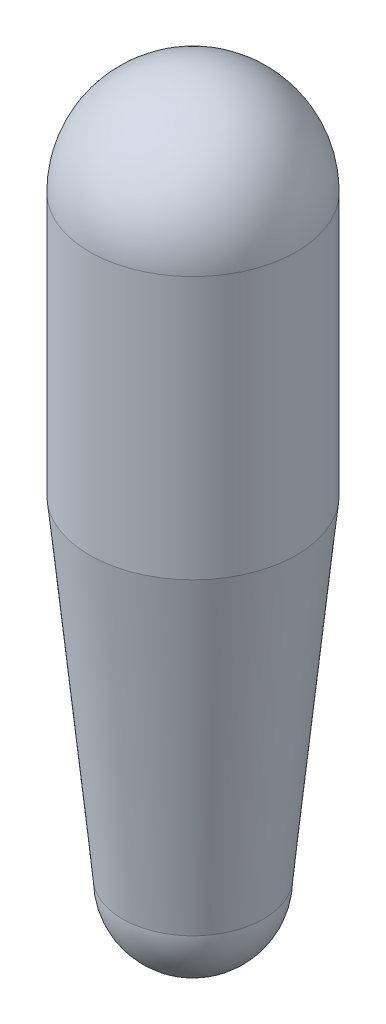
from build123d import *


with BuildPart() as part:
    # Sketch1 → Revolve1 (revolve)
    with BuildSketch(Plane.XY):
        with BuildLine():
            Line((-80.01, 0), (80.01, 0))
            ThreePointArc((80.01, 0), (0, 80.01), (-80.01, 0))
        make_face()
    revolve(axis=Axis((-80.01, 0, 0), (1, 0, 0)))


with BuildPart() as body_2:
    # Sketch2 → Revolve2 (revolve)
    with BuildSketch(Plane.XY):
        with BuildLine():
            Line((-54.61, -459.74), (54.61, -459.74))
            ThreePointArc((54.61, -459.74), (0, -514.35), (-54.61, -459.74))
        make_face()
    revolve(axis=Axis((-54.61, -459.74, 0), (1, 0, 0)))


with BuildPart() as part_1:
    add(part.part)

    add(body_2.part)  # Revolve3 merges body 2
    # Sketch3 → Revolve3 (revolve)
    with BuildSketch(Plane(origin=(0, 0, 0), x_dir=(0, 0, -1), z_dir=(1, 0, 0)), mode=Mode.PRIVATE) as revolve3_sk:
        Polygon((0, 0), (0, -459.74), (54.61, -459.74), (80.01, -203.2), (80.01, 0), align=None)
    revolve(revolve3_sk.sketch.rotate(Axis((0, 0, 0), (0, -1, 0)), 180), axis=Axis((0, 0, 0), (0, -1, 0)))


solid = part_1.part
